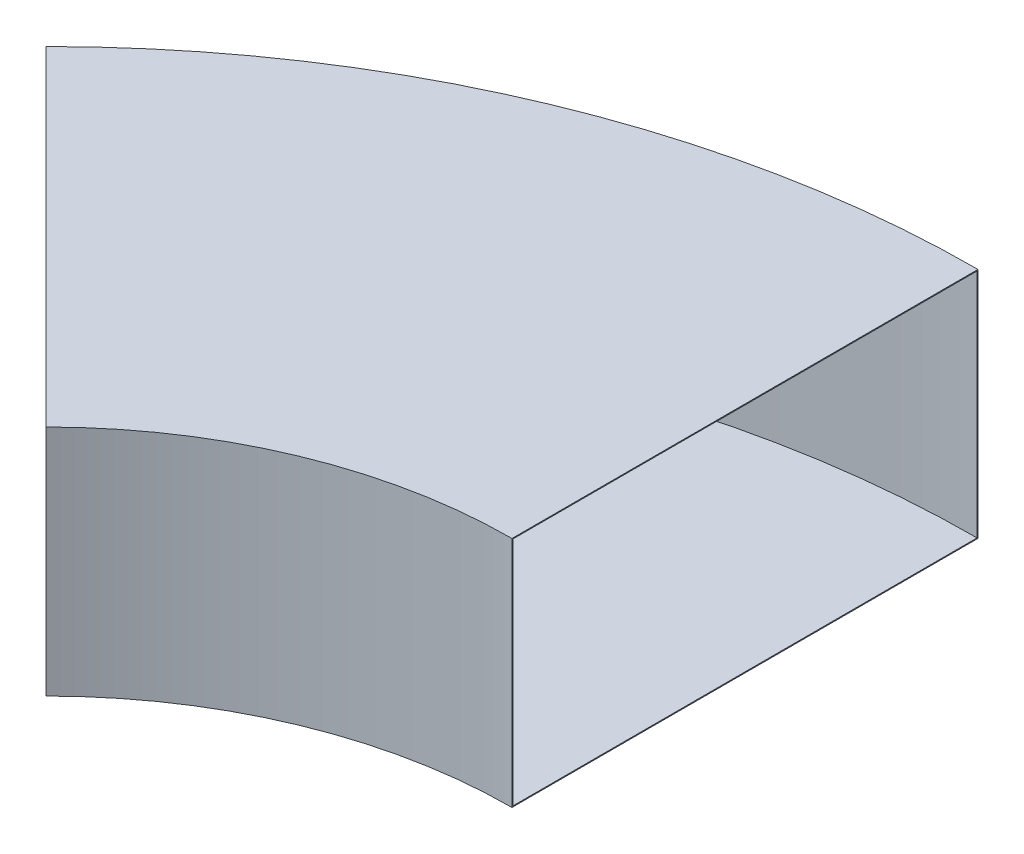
ISO-10303-21;
HEADER;
FILE_DESCRIPTION(('STEP AP214'),'2;1');
FILE_NAME('part.step','',(''),(''),'','','');
FILE_SCHEMA(('AUTOMOTIVE_DESIGN { 1 0 10303 214 1 1 1 1 }'));
ENDSEC;
DATA;
#1=APPLICATION_CONTEXT('core data for automotive mechanical design processes');
#2=APPLICATION_PROTOCOL_DEFINITION('international standard','automotive_design',2000,#1);
#3=PRODUCT_CONTEXT('',#1,'mechanical');
#4=PRODUCT('Part','Part','',(#3));
#5=PRODUCT_RELATED_PRODUCT_CATEGORY('part','',(#4));
#6=PRODUCT_DEFINITION_FORMATION('','',#4);
#7=PRODUCT_DEFINITION_CONTEXT('part definition',#1,'design');
#8=PRODUCT_DEFINITION('design','',#6,#7);
#9=PRODUCT_DEFINITION_SHAPE('','',#8);
#10=(LENGTH_UNIT() NAMED_UNIT(*) SI_UNIT(.MILLI.,.METRE.));
#11=(NAMED_UNIT(*) PLANE_ANGLE_UNIT() SI_UNIT($,.RADIAN.));
#12=(NAMED_UNIT(*) SI_UNIT($,.STERADIAN.) SOLID_ANGLE_UNIT());
#13=UNCERTAINTY_MEASURE_WITH_UNIT(LENGTH_MEASURE(1.E-05),#10,'distance_accuracy_value','');
#14=(GEOMETRIC_REPRESENTATION_CONTEXT(3) GLOBAL_UNCERTAINTY_ASSIGNED_CONTEXT((#13)) GLOBAL_UNIT_ASSIGNED_CONTEXT((#10,
#11,#12)) REPRESENTATION_CONTEXT('',''));
#15=CARTESIAN_POINT('',(0.,0.,0.));
#16=DIRECTION('',(0.,0.,1.));
#17=DIRECTION('',(1.,0.,0.));
#18=AXIS2_PLACEMENT_3D('',#15,#16,#17);
#19=CARTESIAN_POINT('',(0.,0.,0.));
#20=DIRECTION('',(0.,-1.,0.));
#21=DIRECTION('',(0.,0.,-1.));
#22=AXIS2_PLACEMENT_3D('',#19,#20,#21);
#23=CYLINDRICAL_SURFACE('',#22,1000.);
#24=CARTESIAN_POINT('',(0.,-250.000000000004,0.));
#25=DIRECTION('',(0.,-1.,0.));
#26=DIRECTION('',(0.,0.,-1.));
#27=AXIS2_PLACEMENT_3D('',#24,#25,#26);
#28=CIRCLE('',#27,1000.);
#29=CARTESIAN_POINT('',(-707.10678118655,-250.000000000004,-707.106781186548));
#30=VERTEX_POINT('',#29);
#31=CARTESIAN_POINT('',(0.,-250.000000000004,-1000.));
#32=VERTEX_POINT('',#31);
#33=EDGE_CURVE('E11',#30,#32,#28,.T.);
#34=ORIENTED_EDGE('',*,*,#33,.T.);
#35=DIRECTION('',(0.,-1.,0.));
#36=VECTOR('',#35,1.);
#37=CARTESIAN_POINT('',(0.,249.999999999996,-999.999999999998));
#38=LINE('',#37,#36);
#39=CARTESIAN_POINT('',(0.,249.999999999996,-999.999999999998));
#40=VERTEX_POINT('',#39);
#41=EDGE_CURVE('E105',#40,#32,#38,.T.);
#42=ORIENTED_EDGE('',*,*,#41,.F.);
#43=CARTESIAN_POINT('',(0.,249.999999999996,0.));
#44=DIRECTION('',(0.,-1.,0.));
#45=DIRECTION('',(0.,0.,-1.));
#46=AXIS2_PLACEMENT_3D('',#43,#44,#45);
#47=CIRCLE('',#46,999.999999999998);
#48=CARTESIAN_POINT('',(-707.106781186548,249.999999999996,-707.106781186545));
#49=VERTEX_POINT('',#48);
#50=EDGE_CURVE('E154',#49,#40,#47,.T.);
#51=ORIENTED_EDGE('',*,*,#50,.F.);
#52=DIRECTION('',(0.,-1.,0.));
#53=VECTOR('',#52,1.);
#54=CARTESIAN_POINT('',(-707.106781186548,249.999999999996,-707.106781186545));
#55=LINE('',#54,#53);
#56=EDGE_CURVE('E142',#49,#30,#55,.T.);
#57=ORIENTED_EDGE('',*,*,#56,.T.);
#58=EDGE_LOOP('',(#34,#42,#51,#57));
#59=FACE_BOUND('',#58,.T.);
#60=ADVANCED_FACE('F32',(#59),#23,.F.);
#61=CARTESIAN_POINT('',(-707.10678118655,-250.,-707.106781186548));
#62=DIRECTION('',(0.,-1.,0.));
#63=DIRECTION('',(0.,0.,-1.));
#64=AXIS2_PLACEMENT_3D('',#61,#62,#63);
#65=PLANE('',#64);
#66=CARTESIAN_POINT('',(0.,-249.999999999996,0.));
#67=DIRECTION('',(0.,-1.,0.));
#68=DIRECTION('',(0.,0.,-1.));
#69=AXIS2_PLACEMENT_3D('',#66,#67,#68);
#70=CIRCLE('',#69,2000.);
#71=CARTESIAN_POINT('',(-1414.2135623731,-249.999999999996,-1414.21356237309));
#72=VERTEX_POINT('',#71);
#73=CARTESIAN_POINT('',(0.,-249.999999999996,-2000.));
#74=VERTEX_POINT('',#73);
#75=EDGE_CURVE('E40',#72,#74,#70,.T.);
#76=ORIENTED_EDGE('',*,*,#75,.T.);
#77=DIRECTION('',(0.,0.,-1.));
#78=VECTOR('',#77,1.);
#79=CARTESIAN_POINT('',(0.,-250.000000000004,-1000.));
#80=LINE('',#79,#78);
#81=EDGE_CURVE('E133',#32,#74,#80,.T.);
#82=ORIENTED_EDGE('',*,*,#81,.F.);
#83=ORIENTED_EDGE('',*,*,#33,.F.);
#84=DIRECTION('',(-0.707106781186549,0.,-0.707106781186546));
#85=VECTOR('',#84,1.);
#86=CARTESIAN_POINT('',(-707.10678118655,-250.000000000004,-707.106781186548));
#87=LINE('',#86,#85);
#88=EDGE_CURVE('E145',#30,#72,#87,.T.);
#89=ORIENTED_EDGE('',*,*,#88,.T.);
#90=EDGE_LOOP('',(#76,#82,#83,#89));
#91=FACE_BOUND('',#90,.T.);
#92=ADVANCED_FACE('F34',(#91),#65,.T.);
#93=CARTESIAN_POINT('',(0.,0.,0.));
#94=DIRECTION('',(0.,-1.,0.));
#95=DIRECTION('',(0.,0.,-1.));
#96=AXIS2_PLACEMENT_3D('',#93,#94,#95);
#97=CYLINDRICAL_SURFACE('',#96,2000.);
#98=CARTESIAN_POINT('',(0.,250.000000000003,0.));
#99=DIRECTION('',(0.,-1.,0.));
#100=DIRECTION('',(0.,0.,-1.));
#101=AXIS2_PLACEMENT_3D('',#98,#99,#100);
#102=CIRCLE('',#101,2000.);
#103=CARTESIAN_POINT('',(-1414.2135623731,250.000000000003,-1414.21356237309));
#104=VERTEX_POINT('',#103);
#105=CARTESIAN_POINT('',(0.,250.000000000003,-2000.));
#106=VERTEX_POINT('',#105);
#107=EDGE_CURVE('E156',#104,#106,#102,.T.);
#108=ORIENTED_EDGE('',*,*,#107,.T.);
#109=DIRECTION('',(0.,1.,0.));
#110=VECTOR('',#109,1.);
#111=CARTESIAN_POINT('',(0.,250.000000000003,-2000.));
#112=LINE('',#111,#110);
#113=EDGE_CURVE('E136',#74,#106,#112,.T.);
#114=ORIENTED_EDGE('',*,*,#113,.F.);
#115=ORIENTED_EDGE('',*,*,#75,.F.);
#116=DIRECTION('',(0.,1.,0.));
#117=VECTOR('',#116,1.);
#118=CARTESIAN_POINT('',(-1414.2135623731,250.000000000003,-1414.21356237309));
#119=LINE('',#118,#117);
#120=EDGE_CURVE('E148',#72,#104,#119,.T.);
#121=ORIENTED_EDGE('',*,*,#120,.T.);
#122=EDGE_LOOP('',(#108,#114,#115,#121));
#123=FACE_BOUND('',#122,.T.);
#124=ADVANCED_FACE('F165',(#123),#97,.T.);
#125=CARTESIAN_POINT('',(-707.106781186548,250.,-707.106781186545));
#126=DIRECTION('',(0.,1.,0.));
#127=DIRECTION('',(0.,0.,1.));
#128=AXIS2_PLACEMENT_3D('',#125,#126,#127);
#129=PLANE('',#128);
#130=DIRECTION('',(0.707106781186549,0.,0.707106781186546));
#131=VECTOR('',#130,1.);
#132=CARTESIAN_POINT('',(-707.106781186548,249.999999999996,-707.106781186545));
#133=LINE('',#132,#131);
#134=EDGE_CURVE('E151',#104,#49,#133,.T.);
#135=ORIENTED_EDGE('',*,*,#134,.T.);
#136=ORIENTED_EDGE('',*,*,#50,.T.);
#137=DIRECTION('',(0.,0.,1.));
#138=VECTOR('',#137,1.);
#139=CARTESIAN_POINT('',(0.,249.999999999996,-999.999999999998));
#140=LINE('',#139,#138);
#141=EDGE_CURVE('E139',#106,#40,#140,.T.);
#142=ORIENTED_EDGE('',*,*,#141,.F.);
#143=ORIENTED_EDGE('',*,*,#107,.F.);
#144=EDGE_LOOP('',(#135,#136,#142,#143));
#145=FACE_BOUND('',#144,.T.);
#146=ADVANCED_FACE('F168',(#145),#129,.T.);
#147=CARTESIAN_POINT('',(0.,0.,0.));
#148=DIRECTION('',(0.707106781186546,0.,-0.707106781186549));
#149=DIRECTION('',(-0.707106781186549,0.,-0.707106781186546));
#150=AXIS2_PLACEMENT_3D('',#147,#148,#149);
#151=PLANE('',#150);
#152=DIRECTION('',(0.707106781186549,0.,0.707106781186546));
#153=VECTOR('',#152,1.);
#154=CARTESIAN_POINT('',(0.,248.,0.));
#155=LINE('',#154,#153);
#156=CARTESIAN_POINT('',(-1412.79934881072,248.,-1412.79934881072));
#157=VERTEX_POINT('',#156);
#158=CARTESIAN_POINT('',(-708.520994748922,248.,-708.520994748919));
#159=VERTEX_POINT('',#158);
#160=EDGE_CURVE('E126',#157,#159,#155,.T.);
#161=ORIENTED_EDGE('',*,*,#160,.T.);
#162=DIRECTION('',(0.,-1.,0.));
#163=VECTOR('',#162,1.);
#164=CARTESIAN_POINT('',(-708.520994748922,248.,-708.520994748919));
#165=LINE('',#164,#163);
#166=CARTESIAN_POINT('',(-708.520994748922,-248.,-708.520994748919));
#167=VERTEX_POINT('',#166);
#168=EDGE_CURVE('E124',#159,#167,#165,.T.);
#169=ORIENTED_EDGE('',*,*,#168,.T.);
#170=DIRECTION('',(-0.707106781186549,0.,-0.707106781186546));
#171=VECTOR('',#170,1.);
#172=CARTESIAN_POINT('',(0.,-248.,0.));
#173=LINE('',#172,#171);
#174=CARTESIAN_POINT('',(-1412.79934881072,-248.,-1412.79934881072));
#175=VERTEX_POINT('',#174);
#176=EDGE_CURVE('E101',#167,#175,#173,.T.);
#177=ORIENTED_EDGE('',*,*,#176,.T.);
#178=DIRECTION('',(0.,-1.,0.));
#179=VECTOR('',#178,1.);
#180=CARTESIAN_POINT('',(-1412.79934881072,-248.,-1412.79934881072));
#181=LINE('',#180,#179);
#182=EDGE_CURVE('E47',#175,#157,#181,.F.);
#183=ORIENTED_EDGE('',*,*,#182,.T.);
#184=EDGE_LOOP('',(#161,#169,#177,#183));
#185=FACE_BOUND('',#184,.T.);
#186=ORIENTED_EDGE('',*,*,#56,.F.);
#187=ORIENTED_EDGE('',*,*,#134,.F.);
#188=ORIENTED_EDGE('',*,*,#120,.F.);
#189=ORIENTED_EDGE('',*,*,#88,.F.);
#190=EDGE_LOOP('',(#186,#187,#188,#189));
#191=FACE_BOUND('',#190,.T.);
#192=ADVANCED_FACE('F172',(#185,#191),#151,.F.);
#193=CARTESIAN_POINT('',(0.,0.,0.));
#194=DIRECTION('',(1.,0.,0.));
#195=DIRECTION('',(0.,0.,-1.));
#196=AXIS2_PLACEMENT_3D('',#193,#194,#195);
#197=PLANE('',#196);
#198=DIRECTION('',(0.,-1.,0.));
#199=VECTOR('',#198,1.);
#200=CARTESIAN_POINT('',(0.,248.,-1002.));
#201=LINE('',#200,#199);
#202=CARTESIAN_POINT('',(0.,248.,-1002.));
#203=VERTEX_POINT('',#202);
#204=CARTESIAN_POINT('',(0.,-248.,-1002.));
#205=VERTEX_POINT('',#204);
#206=EDGE_CURVE('E109',#203,#205,#201,.T.);
#207=ORIENTED_EDGE('',*,*,#206,.F.);
#208=DIRECTION('',(0.,0.,1.));
#209=VECTOR('',#208,1.);
#210=CARTESIAN_POINT('',(0.,248.,0.));
#211=LINE('',#210,#209);
#212=CARTESIAN_POINT('',(0.,248.,-1998.));
#213=VERTEX_POINT('',#212);
#214=EDGE_CURVE('E119',#213,#203,#211,.T.);
#215=ORIENTED_EDGE('',*,*,#214,.F.);
#216=DIRECTION('',(0.,-1.,0.));
#217=VECTOR('',#216,1.);
#218=CARTESIAN_POINT('',(0.,-248.,-1998.));
#219=LINE('',#218,#217);
#220=CARTESIAN_POINT('',(0.,-248.,-1998.));
#221=VERTEX_POINT('',#220);
#222=EDGE_CURVE('E52',#221,#213,#219,.F.);
#223=ORIENTED_EDGE('',*,*,#222,.F.);
#224=DIRECTION('',(0.,0.,-1.));
#225=VECTOR('',#224,1.);
#226=CARTESIAN_POINT('',(0.,-248.,0.));
#227=LINE('',#226,#225);
#228=EDGE_CURVE('E99',#205,#221,#227,.T.);
#229=ORIENTED_EDGE('',*,*,#228,.F.);
#230=EDGE_LOOP('',(#207,#215,#223,#229));
#231=FACE_BOUND('',#230,.T.);
#232=ORIENTED_EDGE('',*,*,#41,.T.);
#233=ORIENTED_EDGE('',*,*,#81,.T.);
#234=ORIENTED_EDGE('',*,*,#113,.T.);
#235=ORIENTED_EDGE('',*,*,#141,.T.);
#236=EDGE_LOOP('',(#232,#233,#234,#235));
#237=FACE_BOUND('',#236,.T.);
#238=ADVANCED_FACE('F116',(#231,#237),#197,.T.);
#239=CARTESIAN_POINT('',(0.,0.,0.));
#240=DIRECTION('',(0.,-1.,0.));
#241=DIRECTION('',(0.,0.,-1.));
#242=AXIS2_PLACEMENT_3D('',#239,#240,#241);
#243=CYLINDRICAL_SURFACE('',#242,1002.);
#244=CARTESIAN_POINT('',(0.,-248.,0.));
#245=DIRECTION('',(0.,-1.,0.));
#246=DIRECTION('',(0.,0.,-1.));
#247=AXIS2_PLACEMENT_3D('',#244,#245,#246);
#248=CIRCLE('',#247,1002.);
#249=EDGE_CURVE('E95',#167,#205,#248,.T.);
#250=ORIENTED_EDGE('',*,*,#249,.F.);
#251=ORIENTED_EDGE('',*,*,#168,.F.);
#252=CARTESIAN_POINT('',(0.,248.,0.));
#253=DIRECTION('',(0.,1.,0.));
#254=DIRECTION('',(0.,0.,1.));
#255=AXIS2_PLACEMENT_3D('',#252,#253,#254);
#256=CIRCLE('',#255,1002.);
#257=EDGE_CURVE('E111',#159,#203,#256,.F.);
#258=ORIENTED_EDGE('',*,*,#257,.T.);
#259=ORIENTED_EDGE('',*,*,#206,.T.);
#260=EDGE_LOOP('',(#250,#251,#258,#259));
#261=FACE_BOUND('',#260,.T.);
#262=ADVANCED_FACE('F110',(#261),#243,.T.);
#263=CARTESIAN_POINT('',(-707.10678118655,-248.,-707.106781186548));
#264=DIRECTION('',(0.,-1.,0.));
#265=DIRECTION('',(0.,0.,-1.));
#266=AXIS2_PLACEMENT_3D('',#263,#264,#265);
#267=PLANE('',#266);
#268=CARTESIAN_POINT('',(0.,-248.,0.));
#269=DIRECTION('',(0.,-1.,0.));
#270=DIRECTION('',(0.,0.,-1.));
#271=AXIS2_PLACEMENT_3D('',#268,#269,#270);
#272=CIRCLE('',#271,1998.);
#273=EDGE_CURVE('E106',#175,#221,#272,.T.);
#274=ORIENTED_EDGE('',*,*,#273,.F.);
#275=ORIENTED_EDGE('',*,*,#176,.F.);
#276=ORIENTED_EDGE('',*,*,#249,.T.);
#277=ORIENTED_EDGE('',*,*,#228,.T.);
#278=EDGE_LOOP('',(#274,#275,#276,#277));
#279=FACE_BOUND('',#278,.T.);
#280=ADVANCED_FACE('F97',(#279),#267,.F.);
#281=CARTESIAN_POINT('',(0.,0.,0.));
#282=DIRECTION('',(0.,-1.,0.));
#283=DIRECTION('',(0.,0.,-1.));
#284=AXIS2_PLACEMENT_3D('',#281,#282,#283);
#285=CYLINDRICAL_SURFACE('',#284,1998.);
#286=CARTESIAN_POINT('',(0.,248.,0.));
#287=DIRECTION('',(0.,1.,0.));
#288=DIRECTION('',(0.,0.,1.));
#289=AXIS2_PLACEMENT_3D('',#286,#287,#288);
#290=CIRCLE('',#289,1998.);
#291=EDGE_CURVE('E246',#157,#213,#290,.F.);
#292=ORIENTED_EDGE('',*,*,#291,.F.);
#293=ORIENTED_EDGE('',*,*,#182,.F.);
#294=ORIENTED_EDGE('',*,*,#273,.T.);
#295=ORIENTED_EDGE('',*,*,#222,.T.);
#296=EDGE_LOOP('',(#292,#293,#294,#295));
#297=FACE_BOUND('',#296,.T.);
#298=ADVANCED_FACE('F223',(#297),#285,.F.);
#299=CARTESIAN_POINT('',(-707.106781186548,248.,-707.106781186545));
#300=DIRECTION('',(0.,1.,0.));
#301=DIRECTION('',(0.,0.,1.));
#302=AXIS2_PLACEMENT_3D('',#299,#300,#301);
#303=PLANE('',#302);
#304=ORIENTED_EDGE('',*,*,#160,.F.);
#305=ORIENTED_EDGE('',*,*,#291,.T.);
#306=ORIENTED_EDGE('',*,*,#214,.T.);
#307=ORIENTED_EDGE('',*,*,#257,.F.);
#308=EDGE_LOOP('',(#304,#305,#306,#307));
#309=FACE_BOUND('',#308,.T.);
#310=ADVANCED_FACE('F232',(#309),#303,.F.);
#311=CLOSED_SHELL('',(#60,#92,#124,#146,#192,#238,#262,#280,#298,#310));
#312=MANIFOLD_SOLID_BREP('B2',#311);
#313=ADVANCED_BREP_SHAPE_REPRESENTATION('',(#18,#312),#14);
#314=SHAPE_DEFINITION_REPRESENTATION(#9,#313);
ENDSEC;
END-ISO-10303-21;
